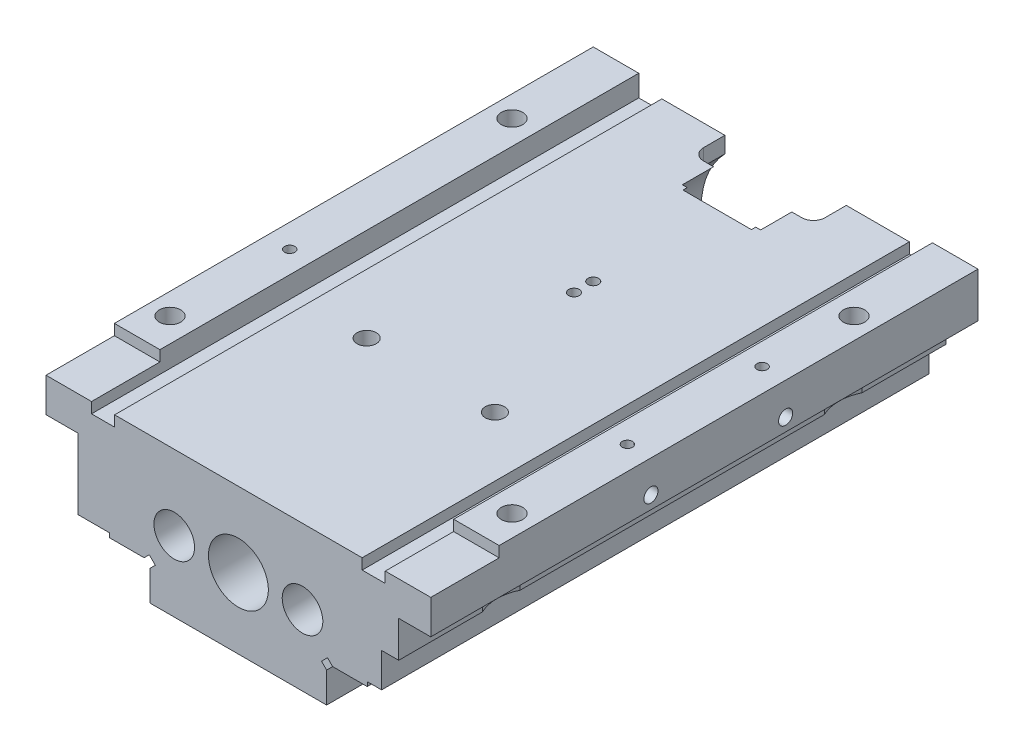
from build123d import *

# Parameters (mm, degrees)
EXTRUSION1_DEPTH           = 128
ESQUISSE2_W                = 4
ESQUISSE2_H                = 8
ENL_V_MAT_EXTRU_2_DEPTH    = 138.145907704
ENL_V_MAT_EXTRU_3_DEPTH    = 20
ESQUISSE6_R                = 2.5
ENL_V_MAT_EXTRU_4_DEPTH    = 141.5035587
ESQUISSE7_R                = 10.2
ENL_V_MAT_EXTRU_5_DEPTH    = 139.148470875
R_P_TITION_LIN_AIRE2_COUNT = 2
R_P_TITION_LIN_AIRE2_PITCH = 80
ESQUISSE9_R                = 2.25
ENL_V_MAT_EXTRU_6_DEPTH    = 8
ESQUISSE10_R               = 1.65
ENL_V_MAT_EXTRU_7_DEPTH    = 15
R_P_TITION_LIN_AIRE4_COUNT = 5
R_P_TITION_LIN_AIRE4_PITCH = 25
ESQUISSE14_R               = 1.2
ENL_V_MAT_EXTRU_9_DEPTH    = 7.7
ESQUISSE15_R               = 1.2
ENL_V_MAT_EXTRU_10_DEPTH   = 20.7
SYM_TRIE3_COPY_1_SKETCH_R  = 2.5
SYM_TRIE3_COPY_1_DEPTH     = 141.5035587
SYM_TRIE3_COPY_2_SKETCH_R  = 10.2
SYM_TRIE3_COPY_2_DEPTH     = 139.148470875
ESQUISSE17_R               = 1.2
ENL_V_MAT_EXTRU_11_DEPTH   = 7.7
ESQUISSE18_R               = 1.25
ENL_V_MAT_EXTRU_12_DEPTH   = 20
R_P_TITION_LIN_AIRE5_COUNT = 2
R_P_TITION_LIN_AIRE5_PITCH = 4.5
ESQUISSE19_W               = 16
ESQUISSE19_H               = 2.5
ENL_V_MAT_EXTRU_13_DEPTH   = 158.746632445
R_P_TITION_LIN_AIRE6_COUNT = 2
R_P_TITION_LIN_AIRE6_PITCH = 78.4
CHANFREIN1_SIZE            = 0.5
ESQUISSE21_W               = 25
ESQUISSE21_H               = 6
ENL_V_MAT_EXTRU_14_DEPTH   = 0.02


with BuildPart() as part:
    # Esquisse1 → Extrusion1 (new body)
    with BuildSketch(Plane.XY):
        Polygon((28.95, 17.5), (-28.95, 17.5), (-28.95, 15), (-34.35, 15), (-34.35, 20), (-45, 20), (-45, 9.5), (-37.5, 9.5), (-37.5, -7), (-30.15, -7), (-30.15, -8), (-22.054213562, -8), (-20.852132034, -6.797918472), (-19.437918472, -8.212132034), (-20.64, -9.414213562), (-20.64, -16.5), (20.64, -16.5), (20.64, -9.414213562), (19.437918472, -8.212132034), (20.852132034, -6.797918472), (22.054213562, -8), (30.15, -8), (30.15, -7), (37.5, -7), (37.5, 9.5), (45, 9.5), (45, 20), (34.35, 20), (34.35, 15), (28.95, 15), align=None)
    extrude(amount=EXTRUSION1_DEPTH)

    # Esquisse2 → Enl_v. mat.-Extru.2 (cut, through all)
    with BuildSketch(Plane.XY):
        with Locations((35.5, -3)):
            Rectangle(ESQUISSE2_W, ESQUISSE2_H)
    extrude(amount=ENL_V_MAT_EXTRU_2_DEPTH, mode=Mode.SUBTRACT)

    # Esquisse3 → Enl_vement de mati_re-R_volution1 (revolve, cut)
    with BuildSketch(Plane(origin=(0, 0, 0), x_dir=(0, 0, -1), z_dir=(1, 0, 0)), mode=Mode.PRIVATE) as enl_vement_de_mati_re_r_volution1_sk:
        Polygon((0, 0), (0, 19.75), (-15, 19.75), (-15, 19.25), (-16, 19.25), (-16, 10), (-41, 10), (-41, 9.5), (-53, 9.5), (-53, 7), (-128, 7), (-128, 0), align=None)
    revolve(enl_vement_de_mati_re_r_volution1_sk.sketch.rotate(Axis((0, 0, 0), (0, 0, 1)), 90), axis=Axis((0, 0, 0), (0, 0, 1)), mode=Mode.SUBTRACT)

    # Esquisse4 → Enl_vement de mati_re-R_volution2 (revolve, cut)
    with BuildSketch(Plane(origin=(0, 0, 0), x_dir=(-0.8660254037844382, -0.500000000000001, 0), z_dir=(-0.500000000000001, 0.8660254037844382, 0)), mode=Mode.PRIVATE) as enl_vement_de_mati_re_r_volution2_sk:
        Polygon((14.5, 16), (16.15, 16), (16.15, 28.047372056), (14.5, 29), align=None)
    enl_vement_de_mati_re_r_volution2 = revolve(enl_vement_de_mati_re_r_volution2_sk.sketch.rotate(Axis((-12.557368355, -7.25, -50.196355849), (0, 0, 1)), 330), axis=Axis((-12.557368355, -7.25, -50.196355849), (0, 0, 1)), mode=Mode.SUBTRACT)

    # Sym_trie1: Enl_vement de mati_re-R_volution2 across plane
    add(enl_vement_de_mati_re_r_volution2.mirror(Plane.ZX), mode=Mode.SUBTRACT)

    # Sym_trie2: Enl_vement de mati_re-R_volution2 across plane
    add(enl_vement_de_mati_re_r_volution2.mirror(Plane(origin=(0, 0, 0), x_dir=(0, 0, 1), z_dir=(1, 0, 0))), mode=Mode.SUBTRACT)

    # Sym_trie2 copy 1 sketch → Sym_trie2 copy 1 (revolve, cut)
    with BuildSketch(Plane(origin=(0, 0, 0), x_dir=(0.8660254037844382, 0.500000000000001, 0), z_dir=(0.500000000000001, -0.8660254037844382, 0))):
        Polygon((14.5, 16), (16.15, 16), (16.15, 28.047372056), (14.5, 29), align=None)
    revolve(axis=Axis((12.557368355, 7.25, -50.196355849), (0, 0, 1)), mode=Mode.SUBTRACT)

    # Esquisse5 → Enl_v. mat.-Extru.3 (cut)
    with BuildSketch(Plane(origin=(0, 17.5, 0), x_dir=(-1, 0, 0), z_dir=(0, 1, 0))):
        with BuildLine():
            Line((-14.2, 0), (14.2, 0))
            Line((14.2, 0), (14.2, 5))
            ThreePointArc((14.2, 5), (13.409188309, 6.909188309), (11.5, 7.7))
            Line((11.5, 7.7), (-11.5, 7.7))
            ThreePointArc((-11.5, 7.7), (-13.409188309, 6.909188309), (-14.2, 5))
            Line((-14.2, 5), (-14.2, 0))
        make_face()
    extrude(amount=-ENL_V_MAT_EXTRU_3_DEPTH, mode=Mode.SUBTRACT)

    # Esquisse6 → Enl_v. mat.-Extru.4 (cut, through all)
    with BuildSketch(Plane(origin=(0, 20, 0), x_dir=(-1, 0, 0), z_dir=(0, 1, 0))):
        with Locations(Location((40, 24, 0), (0, 0, 90))):
            Circle(ESQUISSE6_R)
    enl_v_mat_extru_4 = extrude(amount=-ENL_V_MAT_EXTRU_4_DEPTH, mode=Mode.SUBTRACT)

    # Esquisse7 → Enl_v. mat.-Extru.5 (cut, through all)
    with BuildSketch(Plane.XZ.offset(-9.5)):
        with Locations((-46.7, 24)):
            Circle(ESQUISSE7_R)
    enl_v_mat_extru_5 = extrude(amount=ENL_V_MAT_EXTRU_5_DEPTH, mode=Mode.SUBTRACT)

    # R_p_tition lin_aire2: Enl_v. mat.-Extru.4, Enl_v. mat.-Extru.5 ×2
    with Locations(*[(0, 0, i * R_P_TITION_LIN_AIRE2_PITCH) for i in range(1, R_P_TITION_LIN_AIRE2_COUNT)]):
        add(enl_v_mat_extru_4, mode=Mode.SUBTRACT)
        add(enl_v_mat_extru_5, mode=Mode.SUBTRACT)

    # Esquisse8 → Enl_vement de mati_re-R_volution3 (revolve, cut)
    with BuildSketch(Plane(origin=(0, 0, 0), x_dir=(1, 0, 0), z_dir=(0, 1, 0))):
        Polygon((-15, -128), (-10.25, -128), (-10.25, -78), (-15, -75.257586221), align=None)
    enl_vement_de_mati_re_r_volution3 = revolve(axis=Axis((-15, 0, 152.24018206), (0, 0, -1)), mode=Mode.SUBTRACT)

    # Esquisse9 → Enl_v. mat.-Extru.6 (cut)
    with BuildSketch(Plane(origin=(0, 17.5, 0), x_dir=(-1, 0, 0), z_dir=(0, 1, 0))):
        with Locations(Location((15, 83, 0), (0, 0, 90))):
            Circle(ESQUISSE9_R)
    enl_v_mat_extru_6 = extrude(amount=-ENL_V_MAT_EXTRU_6_DEPTH, mode=Mode.SUBTRACT)

    # Esquisse10 → Enl_v. mat.-Extru.7 (cut)
    with BuildSketch(Plane(origin=(0, 17.5, 0), x_dir=(-1, 0, 0), z_dir=(0, 1, 0))):
        with Locations(Location((15, 83, 0), (0, 0, 90))):
            Circle(ESQUISSE10_R)
    enl_v_mat_extru_7 = extrude(amount=-ENL_V_MAT_EXTRU_7_DEPTH, mode=Mode.SUBTRACT)

    # Esquisse12 → Enl_vement de mati_re-R_volution4 (revolve, cut)
    with BuildSketch(Plane.XY.offset(14), mode=Mode.PRIVATE) as enl_vement_de_mati_re_r_volution4_sk:
        Polygon((-25.49, 5), (-24.24, 4.278312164), (-24.24, -8), (-25.49, -8), align=None)
    enl_vement_de_mati_re_r_volution4 = revolve(enl_vement_de_mati_re_r_volution4_sk.sketch.rotate(Axis((-25.49, -22.99033905, 14), (0, 1, 0)), 90), axis=Axis((-25.49, -22.99033905, 14), (0, 1, 0)), mode=Mode.SUBTRACT)

    # R_p_tition lin_aire4: Enl_vement de mati_re-R_volution4 ×5
    with Locations(*[(0, 0, i * R_P_TITION_LIN_AIRE4_PITCH) for i in range(1, R_P_TITION_LIN_AIRE4_COUNT)]):
        add(enl_vement_de_mati_re_r_volution4, mode=Mode.SUBTRACT)

    # Esquisse13 → Enl_vement de mati_re-R_volution5 (revolve, cut)
    with BuildSketch(Plane.XY.offset(76.5), mode=Mode.PRIVATE) as enl_vement_de_mati_re_r_volution5_sk:
        Polygon((-45, 10.85), (-24, 10.85), (-23.047372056, 12.5), (-45, 12.5), align=None)
    enl_vement_de_mati_re_r_volution5 = revolve(enl_vement_de_mati_re_r_volution5_sk.sketch.rotate(Axis((-47.642332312, 12.5, 76.5), (1, 0, 0)), 270), axis=Axis((-47.642332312, 12.5, 76.5), (1, 0, 0)), mode=Mode.SUBTRACT)

    # Esquisse14 → Enl_v. mat.-Extru.9 (cut)
    with BuildSketch(Plane(origin=(0, 20, 0), x_dir=(-1, 0, 0), z_dir=(0, 1, 0))):
        with Locations(Location((39.5, 76.5, 0), (0, 0, 90))):
            Circle(ESQUISSE14_R)
    enl_v_mat_extru_9 = extrude(amount=-ENL_V_MAT_EXTRU_9_DEPTH, mode=Mode.SUBTRACT)

    # Esquisse15 → Enl_v. mat.-Extru.10 (cut)
    with BuildSketch(Plane.XZ.offset(8)):
        with Locations((-25.49, 76.5)):
            Circle(ESQUISSE15_R)
    enl_v_mat_extru_10 = extrude(amount=-ENL_V_MAT_EXTRU_10_DEPTH, mode=Mode.SUBTRACT)

    # Sym_trie3: Enl_v. mat.-Extru.4, Enl_v. mat.-Extru.5, Enl_vement de mati_re-R_volution3, Enl_v. mat.-Extru.6, Enl_v. mat.-Extru.7, Enl_vement de mati_re-R_volution4, Enl_vement de mati_re-R_volution5, Enl_v. mat.-Extru.9, Enl_v. mat.-Extru.10 across plane
    add(enl_v_mat_extru_4.mirror(Plane(origin=(0, 0, 0), x_dir=(0, 0, 1), z_dir=(1, 0, 0))), mode=Mode.SUBTRACT)
    add(enl_v_mat_extru_5.mirror(Plane(origin=(0, 0, 0), x_dir=(0, 0, 1), z_dir=(1, 0, 0))), mode=Mode.SUBTRACT)
    add(enl_vement_de_mati_re_r_volution3.mirror(Plane(origin=(0, 0, 0), x_dir=(0, 0, 1), z_dir=(1, 0, 0))), mode=Mode.SUBTRACT)
    add(enl_v_mat_extru_6.mirror(Plane(origin=(0, 0, 0), x_dir=(0, 0, 1), z_dir=(1, 0, 0))), mode=Mode.SUBTRACT)
    add(enl_v_mat_extru_7.mirror(Plane(origin=(0, 0, 0), x_dir=(0, 0, 1), z_dir=(1, 0, 0))), mode=Mode.SUBTRACT)
    add(enl_vement_de_mati_re_r_volution4.mirror(Plane(origin=(0, 0, 0), x_dir=(0, 0, 1), z_dir=(1, 0, 0))), mode=Mode.SUBTRACT)
    add(enl_vement_de_mati_re_r_volution5.mirror(Plane(origin=(0, 0, 0), x_dir=(0, 0, 1), z_dir=(1, 0, 0))), mode=Mode.SUBTRACT)
    add(enl_v_mat_extru_9.mirror(Plane(origin=(0, 0, 0), x_dir=(0, 0, 1), z_dir=(1, 0, 0))), mode=Mode.SUBTRACT)
    add(enl_v_mat_extru_10.mirror(Plane(origin=(0, 0, 0), x_dir=(0, 0, 1), z_dir=(1, 0, 0))), mode=Mode.SUBTRACT)

    # Sym_trie3 copy 1 sketch → Sym_trie3 copy 1 (cut, through all)
    with BuildSketch(Plane(origin=(0, 20, 80), x_dir=(1, 0, 0), z_dir=(0, 1, 0))):
        with Locations((40, -24)):
            Circle(SYM_TRIE3_COPY_1_SKETCH_R)
    extrude(amount=-SYM_TRIE3_COPY_1_DEPTH, mode=Mode.SUBTRACT)

    # Sym_trie3 copy 2 sketch → Sym_trie3 copy 2 (cut, through all)
    with BuildSketch(Plane(origin=(0, 9.5, 80), x_dir=(-1, 0, 0), z_dir=(0, -1, 0))):
        with Locations((-46.7, -24)):
            Circle(SYM_TRIE3_COPY_2_SKETCH_R)
    extrude(amount=SYM_TRIE3_COPY_2_DEPTH, mode=Mode.SUBTRACT)

    # Sym_trie3 copy 3 sketch → Sym_trie3 copy 3 (revolve, cut)
    with BuildSketch(Plane(origin=(0, 0, 39), x_dir=(-1, 0, 0), z_dir=(0, 0, 1))):
        Polygon((-25.49, -5), (-24.24, -4.278312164), (-24.24, 8), (-25.49, 8), align=None)
    revolve(axis=Axis((25.49, -22.99033905, 39), (0, -1, 0)), mode=Mode.SUBTRACT)

    # Sym_trie3 copy 4 sketch → Sym_trie3 copy 4 (revolve, cut)
    with BuildSketch(Plane(origin=(0, 0, 64), x_dir=(-1, 0, 0), z_dir=(0, 0, 1))):
        Polygon((-25.49, -5), (-24.24, -4.278312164), (-24.24, 8), (-25.49, 8), align=None)
    revolve(axis=Axis((25.49, -22.99033905, 64), (0, -1, 0)), mode=Mode.SUBTRACT)

    # Sym_trie3 copy 5 sketch → Sym_trie3 copy 5 (revolve, cut)
    with BuildSketch(Plane(origin=(0, 0, 89), x_dir=(-1, 0, 0), z_dir=(0, 0, 1))):
        Polygon((-25.49, -5), (-24.24, -4.278312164), (-24.24, 8), (-25.49, 8), align=None)
    revolve(axis=Axis((25.49, -22.99033905, 89), (0, -1, 0)), mode=Mode.SUBTRACT)

    # Sym_trie3 copy 6 sketch → Sym_trie3 copy 6 (revolve, cut)
    with BuildSketch(Plane(origin=(0, 0, 114), x_dir=(-1, 0, 0), z_dir=(0, 0, 1))):
        Polygon((-25.49, -5), (-24.24, -4.278312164), (-24.24, 8), (-25.49, 8), align=None)
    revolve(axis=Axis((25.49, -22.99033905, 114), (0, -1, 0)), mode=Mode.SUBTRACT)

    # Esquisse16 → Enl_vement de mati_re-R_volution7 (revolve, cut)
    with BuildSketch(Plane.XY.offset(45)):
        Polygon((-3.952627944, 12.5), (-3, 14.15), (45, 14.15), (45, 12.5), align=None)
    revolve(axis=Axis((23.047372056, 12.5, 45), (-1, 0, 0)), mode=Mode.SUBTRACT)

    # Esquisse17 → Enl_v. mat.-Extru.11 (cut)
    with BuildSketch(Plane(origin=(0, 20, 0), x_dir=(-1, 0, 0), z_dir=(0, 1, 0))):
        with Locations(Location((-39.5, 45, 0), (0, 0, 90))):
            Circle(ESQUISSE17_R)
    extrude(amount=-ENL_V_MAT_EXTRU_11_DEPTH, mode=Mode.SUBTRACT)

    # Esquisse18 → Enl_v. mat.-Extru.12 (cut)
    with BuildSketch(Plane(origin=(0, 17.5, 0), x_dir=(-1, 0, 0), z_dir=(0, 1, 0))):
        with Locations(Location((0, 45, 0), (0, 0, 90))):
            Circle(ESQUISSE18_R)
    enl_v_mat_extru_12 = extrude(amount=-ENL_V_MAT_EXTRU_12_DEPTH, mode=Mode.SUBTRACT)

    # R_p_tition lin_aire5: Enl_v. mat.-Extru.12 ×2
    with Locations(*[(0, 0, i * R_P_TITION_LIN_AIRE5_PITCH) for i in range(1, R_P_TITION_LIN_AIRE5_COUNT)]):
        add(enl_v_mat_extru_12, mode=Mode.SUBTRACT)

    # Esquisse19 → Enl_v. mat.-Extru.13 (cut, through all)
    with BuildSketch(Plane(origin=(45, 0, 0), x_dir=(0, 0, -1), z_dir=(1, 0, 0))):
        with Locations((-120, 18.75)):
            Rectangle(ESQUISSE19_W, ESQUISSE19_H)
    extrude(amount=-ENL_V_MAT_EXTRU_13_DEPTH, mode=Mode.SUBTRACT)

    # Esquisse20 → Enl_vement de mati_re-R_volution8 (revolve, cut)
    with BuildSketch(Plane.XY.offset(119)):
        Polygon((-45, 13), (-45, 14.025), (-37, 14.025), (-36.408215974, 13), align=None)
    enl_vement_de_mati_re_r_volution8 = revolve(axis=Axis((-29.022517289, 13, 119), (-1, 0, 0)), mode=Mode.SUBTRACT)

    # R_p_tition lin_aire6: Enl_vement de mati_re-R_volution8 ×2
    with Locations(*[(0, 0, -i * R_P_TITION_LIN_AIRE6_PITCH) for i in range(1, R_P_TITION_LIN_AIRE6_COUNT)]):
        add(enl_vement_de_mati_re_r_volution8, mode=Mode.SUBTRACT)

    # Chanfrein1
    chanfrein1_edges = [part.edges().sort_by_distance(p)[0] for p in [
        (10, 0, 16),
    ]]
    chamfer(chanfrein1_edges, length=CHANFREIN1_SIZE)

    # Esquisse21 → Enl_v. mat.-Extru.14 (cut)
    with BuildSketch(Plane.XZ.offset(16.5)):
        with Locations((0, 118)):
            Rectangle(ESQUISSE21_W, ESQUISSE21_H)
    extrude(amount=-ENL_V_MAT_EXTRU_14_DEPTH, mode=Mode.SUBTRACT)


solid = part.part
